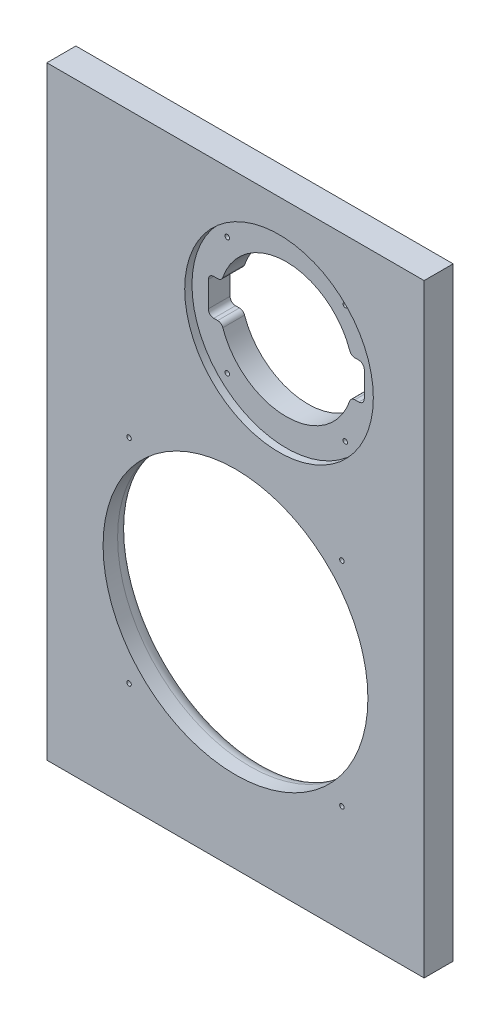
from build123d import *

# Parameters (mm, degrees)
SKETCH_1_W          = 208
SKETCH_1_H          = 333
EXTRUDE_1_DEPTH     = 16
SKETCH_2_R          = 73
CUT_EXTRUDE_1_DEPTH = 402.458590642
SKETCH_3_R          = 52
CUT_EXTRUDE_2_DEPTH = 4
SKETCH_7_R          = 1.25
CUT_EXTRUDE_3_DEPTH = 16
FILLET_1_R          = 8


with BuildPart() as part:
    # Sketch 1 → Extrude 1 (new body)
    with BuildSketch(Plane.XY):
        with Locations((104, -176.5)):
            Rectangle(SKETCH_1_W, SKETCH_1_H)
    extrude(amount=EXTRUDE_1_DEPTH)

    # Sketch 2 → Cut-Extrude 1 (cut, through all)
    with BuildSketch(Plane.XY.offset(16)):
        with Locations((104, -224.997326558)):
            Circle(SKETCH_2_R)
        with BuildLine():
            Line((168, -69.997326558), (165.828560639, -69.997326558))
            ThreePointArc((165.828560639, -69.997326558), (164.085718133, -69.439149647), (162.991418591, -67.972326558))
            ThreePointArc((162.991418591, -67.972326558), (128, -42.997326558), (93.008581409, -67.972326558))
            ThreePointArc((93.008581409, -67.972326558), (91.914281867, -69.439149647), (90.171439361, -69.997326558))
            Line((90.171439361, -69.997326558), (88, -69.997326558))
            ThreePointArc((88, -69.997326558), (85.878679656, -70.876006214), (85, -72.997326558))
            Line((85, -72.997326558), (85, -86.997326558))
            ThreePointArc((85, -86.997326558), (85.878679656, -89.118646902), (88, -89.997326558))
            Line((88, -89.997326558), (90.171439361, -89.997326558))
            ThreePointArc((90.171439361, -89.997326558), (91.914281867, -90.555503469), (93.008581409, -92.022326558))
            ThreePointArc((93.008581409, -92.022326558), (128, -116.997326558), (162.991418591, -92.022326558))
            ThreePointArc((162.991418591, -92.022326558), (164.085718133, -90.555503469), (165.828560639, -89.997326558))
            Line((165.828560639, -89.997326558), (168, -89.997326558))
            ThreePointArc((168, -89.997326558), (170.121320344, -89.118646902), (171, -86.997326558))
            Line((171, -86.997326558), (171, -72.997326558))
            ThreePointArc((171, -72.997326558), (170.121320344, -70.876006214), (168, -69.997326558))
        make_face()
    extrude(amount=-CUT_EXTRUDE_1_DEPTH, mode=Mode.SUBTRACT)

    # Sketch 3 → Cut-Extrude 2 (cut)
    with BuildSketch(Plane.XY.offset(16)):
        with Locations(Location((128, -79.997326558, 0), (0, 0, 180))):
            Circle(SKETCH_3_R)
    extrude(amount=-CUT_EXTRUDE_2_DEPTH, mode=Mode.SUBTRACT)

    # Sketch 7 → Cut-Extrude 3 (cut)
    with BuildSketch(Plane.XY.offset(16)):
        with Locations(Location((160.526911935, -47.470414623, 0), (0, 0, 180))):
            Circle(SKETCH_7_R)
        with Locations((45.310137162, -283.687189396)):
            Circle(SKETCH_7_R)
        with Locations((45.310137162, -166.307463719)):
            Circle(SKETCH_7_R)
        with Locations((162.689862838, -166.307463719)):
            Circle(SKETCH_7_R)
        with Locations((162.689862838, -283.687189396)):
            Circle(SKETCH_7_R)
        with Locations(Location((160.526911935, -112.524238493, 0), (0, 0, 180))):
            Circle(SKETCH_7_R)
        with Locations(Location((95.473088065, -112.524238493, 0), (0, 0, 180))):
            Circle(SKETCH_7_R)
        with Locations(Location((95.473088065, -47.470414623, 0), (0, 0, 180))):
            Circle(SKETCH_7_R)
    extrude(amount=-CUT_EXTRUDE_3_DEPTH, mode=Mode.SUBTRACT)

    # Fillet 1
    fillet_1_edges = [part.edges().sort_by_distance(p)[0] for p in [
        (31, -224.997326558, 0),
    ]]
    fillet(fillet_1_edges, radius=FILLET_1_R)


solid = part.part
